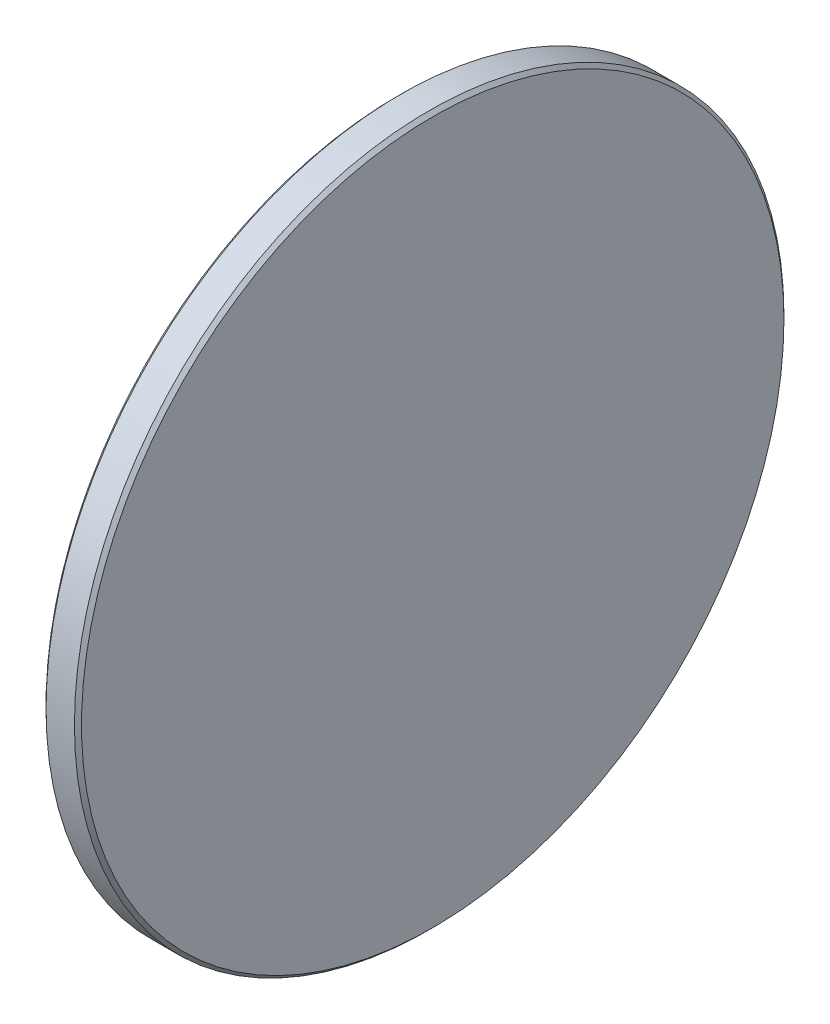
ISO-10303-21;
HEADER;
FILE_DESCRIPTION(('STEP AP214'),'2;1');
FILE_NAME('part.step','',(''),(''),'','','');
FILE_SCHEMA(('AUTOMOTIVE_DESIGN { 1 0 10303 214 1 1 1 1 }'));
ENDSEC;
DATA;
#1=APPLICATION_CONTEXT('core data for automotive mechanical design processes');
#2=APPLICATION_PROTOCOL_DEFINITION('international standard','automotive_design',2000,#1);
#3=PRODUCT_CONTEXT('',#1,'mechanical');
#4=PRODUCT('Part','Part','',(#3));
#5=PRODUCT_RELATED_PRODUCT_CATEGORY('part','',(#4));
#6=PRODUCT_DEFINITION_FORMATION('','',#4);
#7=PRODUCT_DEFINITION_CONTEXT('part definition',#1,'design');
#8=PRODUCT_DEFINITION('design','',#6,#7);
#9=PRODUCT_DEFINITION_SHAPE('','',#8);
#10=(LENGTH_UNIT() NAMED_UNIT(*) SI_UNIT(.MILLI.,.METRE.));
#11=(NAMED_UNIT(*) PLANE_ANGLE_UNIT() SI_UNIT($,.RADIAN.));
#12=(NAMED_UNIT(*) SI_UNIT($,.STERADIAN.) SOLID_ANGLE_UNIT());
#13=UNCERTAINTY_MEASURE_WITH_UNIT(LENGTH_MEASURE(1.E-05),#10,'distance_accuracy_value','');
#14=(GEOMETRIC_REPRESENTATION_CONTEXT(3) GLOBAL_UNCERTAINTY_ASSIGNED_CONTEXT((#13)) GLOBAL_UNIT_ASSIGNED_CONTEXT((#10,
#11,#12)) REPRESENTATION_CONTEXT('',''));
#15=CARTESIAN_POINT('',(0.,0.,0.));
#16=DIRECTION('',(0.,0.,1.));
#17=DIRECTION('',(1.,0.,0.));
#18=AXIS2_PLACEMENT_3D('',#15,#16,#17);
#19=CARTESIAN_POINT('',(12.7,0.,0.));
#20=DIRECTION('',(-1.,0.,0.));
#21=DIRECTION('',(0.,0.,1.));
#22=AXIS2_PLACEMENT_3D('',#19,#20,#21);
#23=CYLINDRICAL_SURFACE('',#22,127.);
#24=CARTESIAN_POINT('',(11.4300000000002,0.,0.));
#25=DIRECTION('',(1.,0.,0.));
#26=DIRECTION('',(0.,0.,-1.));
#27=AXIS2_PLACEMENT_3D('',#24,#25,#26);
#28=CIRCLE('',#27,127.);
#29=CARTESIAN_POINT('',(11.4300000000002,0.,-127.));
#30=VERTEX_POINT('',#29);
#31=EDGE_CURVE('E38',#30,#30,#28,.F.);
#32=ORIENTED_EDGE('',*,*,#31,.T.);
#33=EDGE_LOOP('',(#32));
#34=FACE_BOUND('',#33,.T.);
#35=CARTESIAN_POINT('',(1.27000000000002,0.,0.));
#36=DIRECTION('',(1.,0.,0.));
#37=DIRECTION('',(0.,0.,-1.));
#38=AXIS2_PLACEMENT_3D('',#35,#36,#37);
#39=CIRCLE('',#38,127.);
#40=CARTESIAN_POINT('',(1.27000000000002,0.,-127.));
#41=VERTEX_POINT('',#40);
#42=EDGE_CURVE('E42',#41,#41,#39,.T.);
#43=ORIENTED_EDGE('',*,*,#42,.T.);
#44=EDGE_LOOP('',(#43));
#45=FACE_BOUND('',#44,.T.);
#46=ADVANCED_FACE('F31',(#34,#45),#23,.T.);
#47=CARTESIAN_POINT('',(12.7,0.,0.));
#48=DIRECTION('',(1.,0.,0.));
#49=DIRECTION('',(0.,0.,-1.));
#50=AXIS2_PLACEMENT_3D('',#47,#48,#49);
#51=PLANE('',#50);
#52=CARTESIAN_POINT('',(12.7,0.,0.));
#53=DIRECTION('',(1.,0.,0.));
#54=DIRECTION('',(0.,0.,-1.));
#55=AXIS2_PLACEMENT_3D('',#52,#53,#54);
#56=CIRCLE('',#55,125.73);
#57=CARTESIAN_POINT('',(12.7,0.,-125.73));
#58=VERTEX_POINT('',#57);
#59=EDGE_CURVE('E46',#58,#58,#56,.T.);
#60=ORIENTED_EDGE('',*,*,#59,.T.);
#61=EDGE_LOOP('',(#60));
#62=FACE_BOUND('',#61,.T.);
#63=ADVANCED_FACE('F52',(#62),#51,.T.);
#64=CARTESIAN_POINT('',(0.,0.,0.));
#65=DIRECTION('',(1.,0.,0.));
#66=DIRECTION('',(0.,0.,-1.));
#67=AXIS2_PLACEMENT_3D('',#64,#65,#66);
#68=PLANE('',#67);
#69=CARTESIAN_POINT('',(0.,0.,0.));
#70=DIRECTION('',(1.,0.,0.));
#71=DIRECTION('',(0.,0.,-1.));
#72=AXIS2_PLACEMENT_3D('',#69,#70,#71);
#73=CIRCLE('',#72,125.73);
#74=CARTESIAN_POINT('',(0.,0.,-125.73));
#75=VERTEX_POINT('',#74);
#76=EDGE_CURVE('E10',#75,#75,#73,.F.);
#77=ORIENTED_EDGE('',*,*,#76,.T.);
#78=EDGE_LOOP('',(#77));
#79=FACE_BOUND('',#78,.T.);
#80=ADVANCED_FACE('F56',(#79),#68,.F.);
#81=CARTESIAN_POINT('',(12.7,0.,0.));
#82=DIRECTION('',(-1.,0.,0.));
#83=DIRECTION('',(0.,0.,1.));
#84=AXIS2_PLACEMENT_3D('',#81,#82,#83);
#85=CONICAL_SURFACE('',#84,125.73,0.785398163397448);
#86=ORIENTED_EDGE('',*,*,#31,.F.);
#87=EDGE_LOOP('',(#86));
#88=FACE_BOUND('',#87,.T.);
#89=ORIENTED_EDGE('',*,*,#59,.F.);
#90=EDGE_LOOP('',(#89));
#91=FACE_BOUND('',#90,.T.);
#92=ADVANCED_FACE('F54',(#88,#91),#85,.T.);
#93=CARTESIAN_POINT('',(1.27000000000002,0.,0.));
#94=DIRECTION('',(1.,0.,0.));
#95=DIRECTION('',(0.,0.,-1.));
#96=AXIS2_PLACEMENT_3D('',#93,#94,#95);
#97=CONICAL_SURFACE('',#96,127.,0.785398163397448);
#98=ORIENTED_EDGE('',*,*,#76,.F.);
#99=EDGE_LOOP('',(#98));
#100=FACE_BOUND('',#99,.T.);
#101=ORIENTED_EDGE('',*,*,#42,.F.);
#102=EDGE_LOOP('',(#101));
#103=FACE_BOUND('',#102,.T.);
#104=ADVANCED_FACE('F33',(#100,#103),#97,.T.);
#105=CLOSED_SHELL('',(#46,#63,#80,#92,#104));
#106=MANIFOLD_SOLID_BREP('B2',#105);
#107=ADVANCED_BREP_SHAPE_REPRESENTATION('',(#18,#106),#14);
#108=SHAPE_DEFINITION_REPRESENTATION(#9,#107);
ENDSEC;
END-ISO-10303-21;
